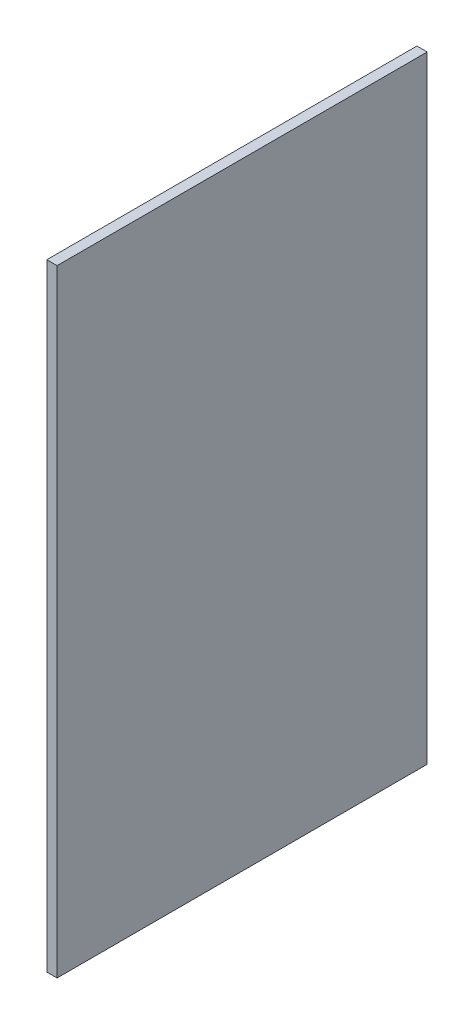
ISO-10303-21;
HEADER;
FILE_DESCRIPTION(('STEP AP214'),'2;1');
FILE_NAME('part.step','',(''),(''),'','','');
FILE_SCHEMA(('AUTOMOTIVE_DESIGN { 1 0 10303 214 1 1 1 1 }'));
ENDSEC;
DATA;
#1=APPLICATION_CONTEXT('core data for automotive mechanical design processes');
#2=APPLICATION_PROTOCOL_DEFINITION('international standard','automotive_design',2000,#1);
#3=PRODUCT_CONTEXT('',#1,'mechanical');
#4=PRODUCT('Part','Part','',(#3));
#5=PRODUCT_RELATED_PRODUCT_CATEGORY('part','',(#4));
#6=PRODUCT_DEFINITION_FORMATION('','',#4);
#7=PRODUCT_DEFINITION_CONTEXT('part definition',#1,'design');
#8=PRODUCT_DEFINITION('design','',#6,#7);
#9=PRODUCT_DEFINITION_SHAPE('','',#8);
#10=(LENGTH_UNIT() NAMED_UNIT(*) SI_UNIT(.MILLI.,.METRE.));
#11=(NAMED_UNIT(*) PLANE_ANGLE_UNIT() SI_UNIT($,.RADIAN.));
#12=(NAMED_UNIT(*) SI_UNIT($,.STERADIAN.) SOLID_ANGLE_UNIT());
#13=UNCERTAINTY_MEASURE_WITH_UNIT(LENGTH_MEASURE(1.E-05),#10,'distance_accuracy_value','');
#14=(GEOMETRIC_REPRESENTATION_CONTEXT(3) GLOBAL_UNCERTAINTY_ASSIGNED_CONTEXT((#13)) GLOBAL_UNIT_ASSIGNED_CONTEXT((#10,
#11,#12)) REPRESENTATION_CONTEXT('',''));
#15=CARTESIAN_POINT('',(0.,0.,0.));
#16=DIRECTION('',(0.,0.,1.));
#17=DIRECTION('',(1.,0.,0.));
#18=AXIS2_PLACEMENT_3D('',#15,#16,#17);
#19=CARTESIAN_POINT('',(-50.5375308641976,299.73164021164,216.));
#20=DIRECTION('',(1.,0.,0.));
#21=DIRECTION('',(0.,1.,0.));
#22=AXIS2_PLACEMENT_3D('',#19,#20,#21);
#23=PLANE('',#22);
#24=DIRECTION('',(0.,-1.,0.));
#25=VECTOR('',#24,1.);
#26=CARTESIAN_POINT('',(-50.5375308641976,299.73164021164,0.));
#27=LINE('',#26,#25);
#28=CARTESIAN_POINT('',(-50.5375308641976,299.73164021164,0.));
#29=VERTEX_POINT('',#28);
#30=CARTESIAN_POINT('',(-50.5375308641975,-60.2683597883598,0.));
#31=VERTEX_POINT('',#30);
#32=EDGE_CURVE('E74',#29,#31,#27,.T.);
#33=ORIENTED_EDGE('',*,*,#32,.T.);
#34=DIRECTION('',(0.,0.,-1.));
#35=VECTOR('',#34,1.);
#36=CARTESIAN_POINT('',(-50.5375308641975,-60.2683597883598,216.));
#37=LINE('',#36,#35);
#38=CARTESIAN_POINT('',(-50.5375308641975,-60.2683597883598,216.));
#39=VERTEX_POINT('',#38);
#40=EDGE_CURVE('E11',#39,#31,#37,.T.);
#41=ORIENTED_EDGE('',*,*,#40,.F.);
#42=DIRECTION('',(0.,-1.,0.));
#43=VECTOR('',#42,1.);
#44=CARTESIAN_POINT('',(-50.5375308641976,299.73164021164,216.));
#45=LINE('',#44,#43);
#46=CARTESIAN_POINT('',(-50.5375308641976,299.73164021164,216.));
#47=VERTEX_POINT('',#46);
#48=EDGE_CURVE('E92',#47,#39,#45,.T.);
#49=ORIENTED_EDGE('',*,*,#48,.F.);
#50=DIRECTION('',(0.,0.,-1.));
#51=VECTOR('',#50,1.);
#52=CARTESIAN_POINT('',(-50.5375308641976,299.73164021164,216.));
#53=LINE('',#52,#51);
#54=EDGE_CURVE('E86',#47,#29,#53,.T.);
#55=ORIENTED_EDGE('',*,*,#54,.T.);
#56=EDGE_LOOP('',(#33,#41,#49,#55));
#57=FACE_BOUND('',#56,.T.);
#58=ADVANCED_FACE('F30',(#57),#23,.F.);
#59=CARTESIAN_POINT('',(-50.5375308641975,-60.2683597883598,216.));
#60=DIRECTION('',(0.,1.,0.));
#61=DIRECTION('',(0.,0.,1.));
#62=AXIS2_PLACEMENT_3D('',#59,#60,#61);
#63=PLANE('',#62);
#64=DIRECTION('',(1.,0.,0.));
#65=VECTOR('',#64,1.);
#66=CARTESIAN_POINT('',(-50.5375308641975,-60.2683597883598,0.));
#67=LINE('',#66,#65);
#68=CARTESIAN_POINT('',(-44.5375308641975,-60.2683597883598,0.));
#69=VERTEX_POINT('',#68);
#70=EDGE_CURVE('E70',#31,#69,#67,.T.);
#71=ORIENTED_EDGE('',*,*,#70,.T.);
#72=DIRECTION('',(0.,0.,-1.));
#73=VECTOR('',#72,1.);
#74=CARTESIAN_POINT('',(-44.5375308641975,-60.2683597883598,216.));
#75=LINE('',#74,#73);
#76=CARTESIAN_POINT('',(-44.5375308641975,-60.2683597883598,216.));
#77=VERTEX_POINT('',#76);
#78=EDGE_CURVE('E37',#77,#69,#75,.T.);
#79=ORIENTED_EDGE('',*,*,#78,.F.);
#80=DIRECTION('',(1.,0.,0.));
#81=VECTOR('',#80,1.);
#82=CARTESIAN_POINT('',(-50.5375308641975,-60.2683597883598,216.));
#83=LINE('',#82,#81);
#84=EDGE_CURVE('E82',#39,#77,#83,.T.);
#85=ORIENTED_EDGE('',*,*,#84,.F.);
#86=ORIENTED_EDGE('',*,*,#40,.T.);
#87=EDGE_LOOP('',(#71,#79,#85,#86));
#88=FACE_BOUND('',#87,.T.);
#89=ADVANCED_FACE('F81',(#88),#63,.F.);
#90=CARTESIAN_POINT('',(-44.5375308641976,299.73164021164,216.));
#91=DIRECTION('',(-1.,0.,0.));
#92=DIRECTION('',(0.,-1.,0.));
#93=AXIS2_PLACEMENT_3D('',#90,#91,#92);
#94=PLANE('',#93);
#95=DIRECTION('',(0.,1.,0.));
#96=VECTOR('',#95,1.);
#97=CARTESIAN_POINT('',(-44.5375308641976,299.73164021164,0.));
#98=LINE('',#97,#96);
#99=CARTESIAN_POINT('',(-44.5375308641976,299.73164021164,0.));
#100=VERTEX_POINT('',#99);
#101=EDGE_CURVE('E75',#69,#100,#98,.T.);
#102=ORIENTED_EDGE('',*,*,#101,.T.);
#103=DIRECTION('',(0.,0.,-1.));
#104=VECTOR('',#103,1.);
#105=CARTESIAN_POINT('',(-44.5375308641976,299.73164021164,216.));
#106=LINE('',#105,#104);
#107=CARTESIAN_POINT('',(-44.5375308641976,299.73164021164,216.));
#108=VERTEX_POINT('',#107);
#109=EDGE_CURVE('E98',#108,#100,#106,.T.);
#110=ORIENTED_EDGE('',*,*,#109,.F.);
#111=DIRECTION('',(0.,1.,0.));
#112=VECTOR('',#111,1.);
#113=CARTESIAN_POINT('',(-44.5375308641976,299.73164021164,216.));
#114=LINE('',#113,#112);
#115=EDGE_CURVE('E49',#77,#108,#114,.T.);
#116=ORIENTED_EDGE('',*,*,#115,.F.);
#117=ORIENTED_EDGE('',*,*,#78,.T.);
#118=EDGE_LOOP('',(#102,#110,#116,#117));
#119=FACE_BOUND('',#118,.T.);
#120=ADVANCED_FACE('F101',(#119),#94,.F.);
#121=CARTESIAN_POINT('',(-50.5375308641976,299.73164021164,216.));
#122=DIRECTION('',(0.,-1.,0.));
#123=DIRECTION('',(0.,0.,-1.));
#124=AXIS2_PLACEMENT_3D('',#121,#122,#123);
#125=PLANE('',#124);
#126=DIRECTION('',(-1.,0.,0.));
#127=VECTOR('',#126,1.);
#128=CARTESIAN_POINT('',(-50.5375308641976,299.73164021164,0.));
#129=LINE('',#128,#127);
#130=EDGE_CURVE('E90',#100,#29,#129,.T.);
#131=ORIENTED_EDGE('',*,*,#130,.T.);
#132=ORIENTED_EDGE('',*,*,#54,.F.);
#133=DIRECTION('',(-1.,0.,0.));
#134=VECTOR('',#133,1.);
#135=CARTESIAN_POINT('',(-50.5375308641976,299.73164021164,216.));
#136=LINE('',#135,#134);
#137=EDGE_CURVE('E44',#108,#47,#136,.T.);
#138=ORIENTED_EDGE('',*,*,#137,.F.);
#139=ORIENTED_EDGE('',*,*,#109,.T.);
#140=EDGE_LOOP('',(#131,#132,#138,#139));
#141=FACE_BOUND('',#140,.T.);
#142=ADVANCED_FACE('F103',(#141),#125,.F.);
#143=CARTESIAN_POINT('',(-50.5375308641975,-60.2683597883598,216.));
#144=DIRECTION('',(0.,0.,1.));
#145=DIRECTION('',(1.,0.,0.));
#146=AXIS2_PLACEMENT_3D('',#143,#144,#145);
#147=PLANE('',#146);
#148=ORIENTED_EDGE('',*,*,#48,.T.);
#149=ORIENTED_EDGE('',*,*,#84,.T.);
#150=ORIENTED_EDGE('',*,*,#115,.T.);
#151=ORIENTED_EDGE('',*,*,#137,.T.);
#152=EDGE_LOOP('',(#148,#149,#150,#151));
#153=FACE_BOUND('',#152,.T.);
#154=ADVANCED_FACE('F104',(#153),#147,.T.);
#155=CARTESIAN_POINT('',(-50.5375308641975,-60.2683597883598,0.));
#156=DIRECTION('',(0.,0.,1.));
#157=DIRECTION('',(1.,0.,0.));
#158=AXIS2_PLACEMENT_3D('',#155,#156,#157);
#159=PLANE('',#158);
#160=ORIENTED_EDGE('',*,*,#32,.F.);
#161=ORIENTED_EDGE('',*,*,#130,.F.);
#162=ORIENTED_EDGE('',*,*,#101,.F.);
#163=ORIENTED_EDGE('',*,*,#70,.F.);
#164=EDGE_LOOP('',(#160,#161,#162,#163));
#165=FACE_BOUND('',#164,.T.);
#166=ADVANCED_FACE('F71',(#165),#159,.F.);
#167=CLOSED_SHELL('',(#58,#89,#120,#142,#154,#166));
#168=MANIFOLD_SOLID_BREP('B2',#167);
#169=ADVANCED_BREP_SHAPE_REPRESENTATION('',(#18,#168),#14);
#170=SHAPE_DEFINITION_REPRESENTATION(#9,#169);
ENDSEC;
END-ISO-10303-21;
